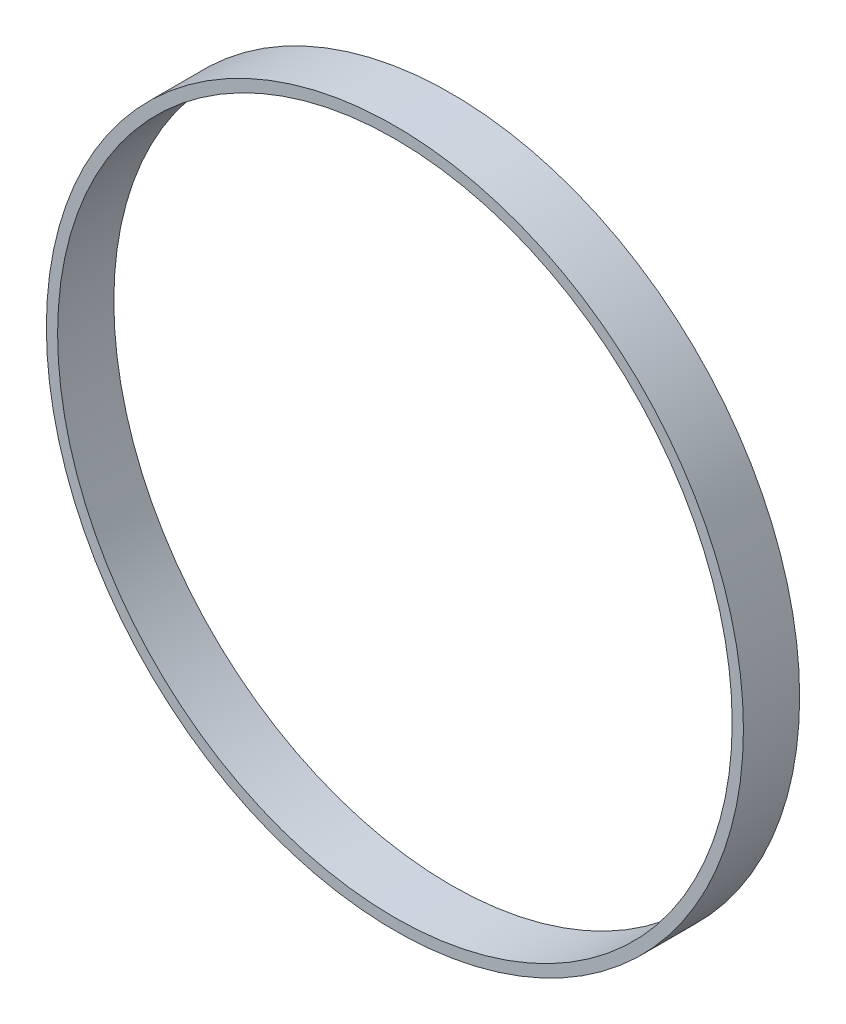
from build123d import *

# Parameters (mm, degrees)
ESQUISSE1_R      = 31
ESQUISSE1_R_2    = 30
EXTRUSION1_DEPTH = 5


with BuildPart() as part:
    # Esquisse1 → Extrusion1 (new body)
    with BuildSketch(Plane.XY):
        Circle(ESQUISSE1_R)
        Circle(ESQUISSE1_R_2, mode=Mode.SUBTRACT)
    extrude(amount=EXTRUSION1_DEPTH)


solid = part.part
